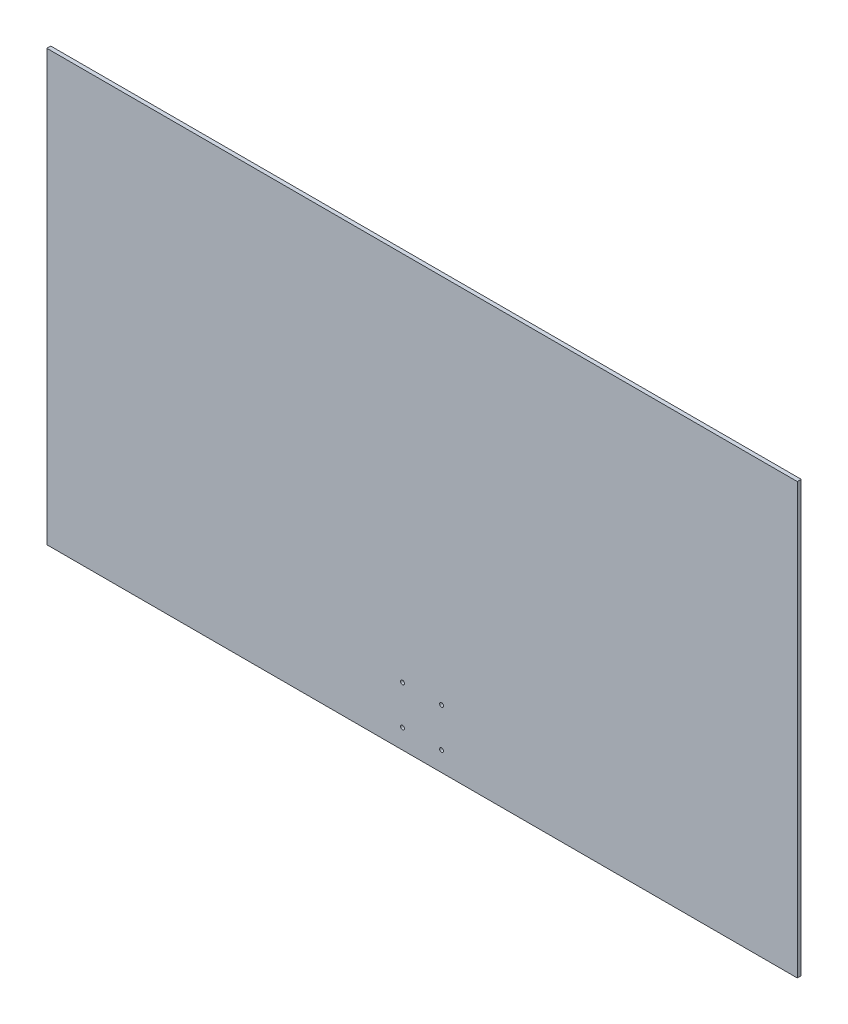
from build123d import *

# Parameters (mm, degrees)
ESQUISSE1_W        = 960
ESQUISSE1_H        = 550
ESQUISSE1_R        = 2.5
BOSS_EXTRU_1_DEPTH = 5


with BuildPart() as part:
    # Esquisse1 → Boss.-Extru.1 (new body)
    with BuildSketch(Plane.XY):
        with Locations((480, 275)):
            Rectangle(ESQUISSE1_W, ESQUISSE1_H)
        with Locations((455, 25)):
            Circle(ESQUISSE1_R, mode=Mode.SUBTRACT)
        with Locations((455, 75)):
            Circle(ESQUISSE1_R, mode=Mode.SUBTRACT)
        with Locations(Location((505, 25, 0), (0, 0, 180))):
            Circle(ESQUISSE1_R, mode=Mode.SUBTRACT)
        with Locations(Location((505, 75, 0), (0, 0, 180))):
            Circle(ESQUISSE1_R, mode=Mode.SUBTRACT)
    extrude(amount=BOSS_EXTRU_1_DEPTH)


solid = part.part
